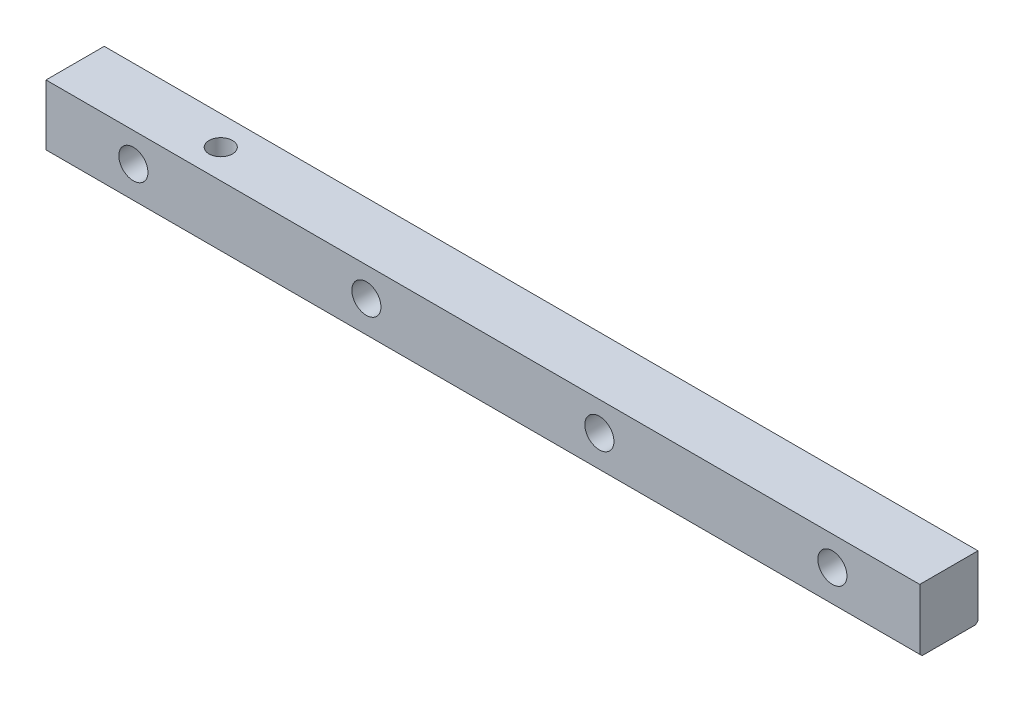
from build123d import *

# Parameters (mm, degrees)
SKETCH1_W            = 190.5
SKETCH1_H            = 13.716
EXTRUDE1_DEPTH       = 12.7
SKETCH2_R            = 3.175
MOUNTING_HOLES_DEPTH = 297.945605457
CHAMFER1_SIZE        = 0.508
SKETCH3_R            = 2.5527
CUT_EXTRUDE1_DEPTH   = 211.382083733


with BuildPart() as part:
    # Sketch1 → Extrude1 (new body)
    with BuildSketch(Plane.XY):
        with Locations((-114.3, 203.152)):
            Rectangle(SKETCH1_W, SKETCH1_H)
    extrude(amount=EXTRUDE1_DEPTH)

    # Sketch2 → mounting holes (cut, through all)
    with BuildSketch(Plane.XY.offset(12.7)):
        with Locations((-190.5, 203.66)):
            Circle(SKETCH2_R)
        with Locations((-139.7, 203.66)):
            Circle(SKETCH2_R)
        with Locations((-88.9, 203.66)):
            Circle(SKETCH2_R)
        with Locations((-38.1, 203.66)):
            Circle(SKETCH2_R)
    extrude(amount=-MOUNTING_HOLES_DEPTH, mode=Mode.SUBTRACT)

    # Chamfer1
    chamfer1_edges = [part.edges().sort_by_distance(p)[0] for p in [
        (-114.3, 196.294, 0),
        (-114.3, 196.294, 12.7),
    ]]
    chamfer(chamfer1_edges, length=CHAMFER1_SIZE)

    # Sketch3 → Cut-Extrude1 (cut, through all)
    with BuildSketch(Plane(origin=(0, 210.01, 0), x_dir=(1, 0, 0), z_dir=(0, 1, 0))):
        with Locations(Location((-177.8, -6.35, 0), (0, 0, 180))):
            Circle(SKETCH3_R)
    extrude(amount=-CUT_EXTRUDE1_DEPTH, mode=Mode.SUBTRACT)


solid = part.part
